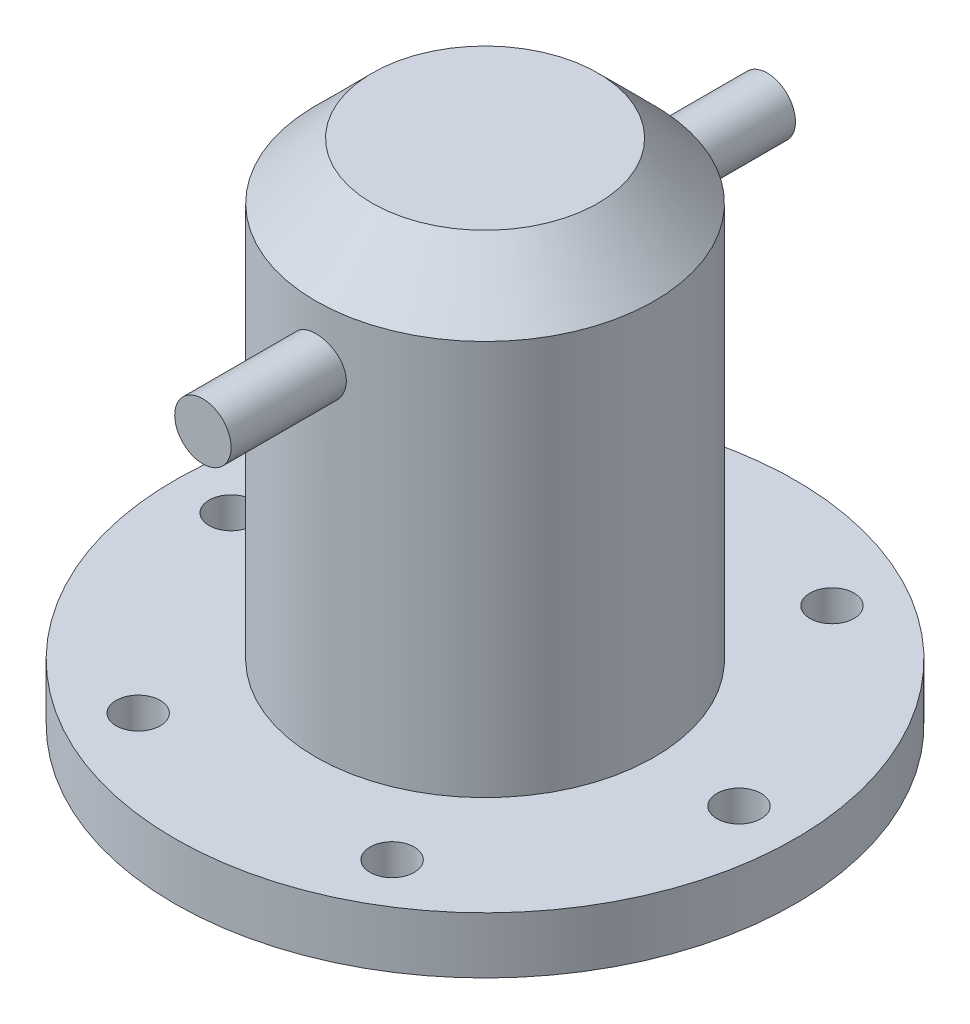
from build123d import *

# Parameters (mm, degrees)
SKETCH2_R          = 6.35
EXTRUDE1_DEPTH     = 63.5
SKETCH3_R          = 4.9657
CUT_EXTRUDE1_DEPTH = 12.7
CIRPATTERN1_COUNT  = 6


with BuildPart() as part:
    # Sketch1 → Revolve1 (revolve)
    with BuildSketch(Plane.XY, mode=Mode.PRIVATE) as revolve1_sk:
        Polygon((0, 0), (0, 114.3), (25.4, 114.3), (38.1, 101.6), (38.1, 12.7), (69.85, 12.7), (69.85, 0), align=None)
    revolve(revolve1_sk.sketch.rotate(Axis((0, 0, 0), (0, -1, 0)), 90), axis=Axis((0, 0, 0), (0, -1, 0)))

    # Sketch2 → Extrude1 (add, symmetric)
    with BuildSketch(Plane.XY):
        with Locations(Location((0, 88.9, 0), (0, 0, 180))):
            Circle(SKETCH2_R)
    extrude(amount=EXTRUDE1_DEPTH, both=True)

    # Sketch3 → Cut-Extrude1 (cut)
    with BuildSketch(Plane(origin=(0, 12.7, 0), x_dir=(-1, 0, 0), z_dir=(0, 1, 0))):
        with Locations(Location((-57.15, 0, 0), (0, 0, 90))):
            Circle(SKETCH3_R)
    cut_extrude1 = extrude(amount=-CUT_EXTRUDE1_DEPTH, mode=Mode.SUBTRACT)

    # CirPattern1: Cut-Extrude1 ×6 about axis
    cirpattern1_axis = Axis((0, 0, 0), (0, 1, 0))
    for i in range(1, CIRPATTERN1_COUNT):
        add(cut_extrude1.rotate(cirpattern1_axis, i * 360 / CIRPATTERN1_COUNT), mode=Mode.SUBTRACT)


solid = part.part
